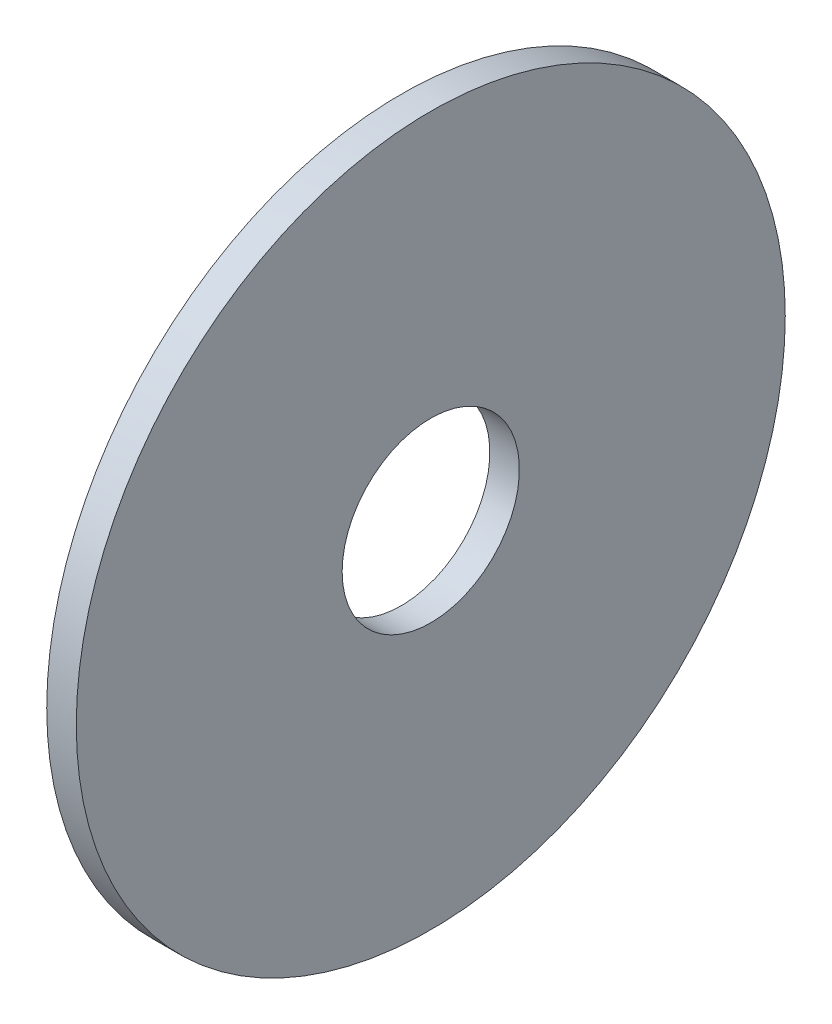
from build123d import *

# Parameters (mm, degrees)
SKETCH1_W = 1
SKETCH1_H = 9


with BuildPart() as part:
    # Sketch1 → Revolve1 (revolve)
    with BuildSketch(Plane(origin=(0, 0, 0), x_dir=(-1, 0, 0), z_dir=(0, 0, -1)), mode=Mode.PRIVATE) as revolve1_sk:
        with Locations((0, 7.5)):
            Rectangle(SKETCH1_W, SKETCH1_H)
    revolve(revolve1_sk.sketch.rotate(Axis((0.5, 0, 0), (-1, 0, 0)), 270), axis=Axis((0.5, 0, 0), (-1, 0, 0)))


solid = part.part
